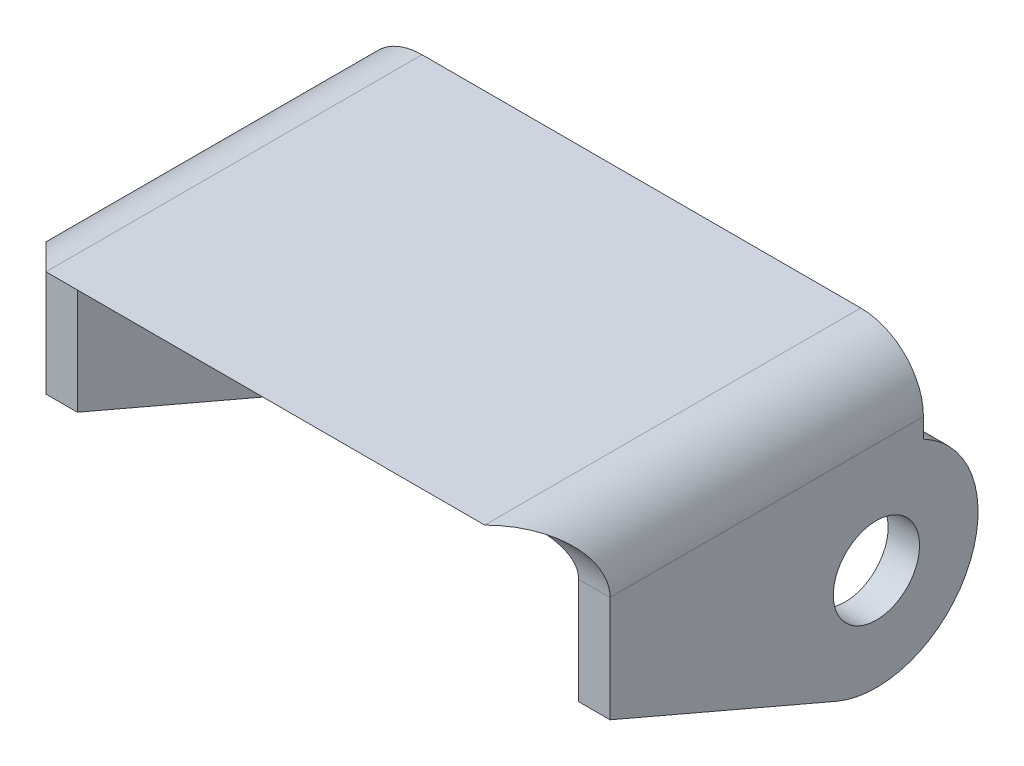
ISO-10303-21;
HEADER;
FILE_DESCRIPTION(('STEP AP214'),'2;1');
FILE_NAME('part.step','',(''),(''),'','','');
FILE_SCHEMA(('AUTOMOTIVE_DESIGN { 1 0 10303 214 1 1 1 1 }'));
ENDSEC;
DATA;
#1=APPLICATION_CONTEXT('core data for automotive mechanical design processes');
#2=APPLICATION_PROTOCOL_DEFINITION('international standard','automotive_design',2000,#1);
#3=PRODUCT_CONTEXT('',#1,'mechanical');
#4=PRODUCT('Part','Part','',(#3));
#5=PRODUCT_RELATED_PRODUCT_CATEGORY('part','',(#4));
#6=PRODUCT_DEFINITION_FORMATION('','',#4);
#7=PRODUCT_DEFINITION_CONTEXT('part definition',#1,'design');
#8=PRODUCT_DEFINITION('design','',#6,#7);
#9=PRODUCT_DEFINITION_SHAPE('','',#8);
#10=(LENGTH_UNIT() NAMED_UNIT(*) SI_UNIT(.MILLI.,.METRE.));
#11=(NAMED_UNIT(*) PLANE_ANGLE_UNIT() SI_UNIT($,.RADIAN.));
#12=(NAMED_UNIT(*) SI_UNIT($,.STERADIAN.) SOLID_ANGLE_UNIT());
#13=UNCERTAINTY_MEASURE_WITH_UNIT(LENGTH_MEASURE(1.E-05),#10,'distance_accuracy_value','');
#14=(GEOMETRIC_REPRESENTATION_CONTEXT(3) GLOBAL_UNCERTAINTY_ASSIGNED_CONTEXT((#13)) GLOBAL_UNIT_ASSIGNED_CONTEXT((#10,
#11,#12)) REPRESENTATION_CONTEXT('',''));
#15=CARTESIAN_POINT('',(0.,0.,0.));
#16=DIRECTION('',(0.,0.,1.));
#17=DIRECTION('',(1.,0.,0.));
#18=AXIS2_PLACEMENT_3D('',#15,#16,#17);
#19=CARTESIAN_POINT('',(153.426643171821,135.018592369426,88.9));
#20=DIRECTION('',(-1.,0.,0.));
#21=DIRECTION('',(0.,-1.,0.));
#22=AXIS2_PLACEMENT_3D('',#19,#20,#21);
#23=PLANE('',#22);
#24=CARTESIAN_POINT('',(153.426643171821,112.793592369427,22.225));
#25=DIRECTION('',(-1.,0.,0.));
#26=DIRECTION('',(0.,-1.,0.));
#27=AXIS2_PLACEMENT_3D('',#24,#25,#26);
#28=CIRCLE('',#27,8.73125000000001);
#29=CARTESIAN_POINT('',(153.426643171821,104.062342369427,22.225));
#30=VERTEX_POINT('',#29);
#31=EDGE_CURVE('E241',#30,#30,#28,.T.);
#32=ORIENTED_EDGE('',*,*,#31,.T.);
#33=EDGE_LOOP('',(#32));
#34=FACE_BOUND('',#33,.T.);
#35=DIRECTION('',(0.,0.,-1.));
#36=VECTOR('',#35,1.);
#37=CARTESIAN_POINT('',(153.426643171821,135.018592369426,88.9));
#38=LINE('',#37,#36);
#39=CARTESIAN_POINT('',(153.426643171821,135.018592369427,76.2));
#40=VERTEX_POINT('',#39);
#41=CARTESIAN_POINT('',(153.426643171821,135.018592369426,12.7));
#42=VERTEX_POINT('',#41);
#43=EDGE_CURVE('E11',#40,#42,#38,.T.);
#44=ORIENTED_EDGE('',*,*,#43,.F.);
#45=DIRECTION('',(0.,-1.,0.));
#46=VECTOR('',#45,1.);
#47=CARTESIAN_POINT('',(153.426643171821,135.018592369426,76.2));
#48=LINE('',#47,#46);
#49=CARTESIAN_POINT('',(153.426643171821,113.547017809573,76.2));
#50=VERTEX_POINT('',#49);
#51=EDGE_CURVE('E245',#40,#50,#48,.T.);
#52=ORIENTED_EDGE('',*,*,#51,.T.);
#53=DIRECTION('',(0.,-0.394402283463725,-0.918937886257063));
#54=VECTOR('',#53,1.);
#55=CARTESIAN_POINT('',(153.426643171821,121.489865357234,94.7064434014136));
#56=LINE('',#55,#54);
#57=CARTESIAN_POINT('',(153.426643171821,93.8675960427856,30.3479169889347));
#58=VERTEX_POINT('',#57);
#59=EDGE_CURVE('E288',#50,#58,#56,.T.);
#60=ORIENTED_EDGE('',*,*,#59,.T.);
#61=CARTESIAN_POINT('',(153.426643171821,112.793592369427,22.225));
#62=DIRECTION('',(-1.,0.,0.));
#63=DIRECTION('',(0.,-1.,0.));
#64=AXIS2_PLACEMENT_3D('',#61,#62,#63);
#65=CIRCLE('',#64,20.5955120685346);
#66=CARTESIAN_POINT('',(153.426643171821,131.05419182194,12.7));
#67=VERTEX_POINT('',#66);
#68=EDGE_CURVE('E293',#58,#67,#65,.F.);
#69=ORIENTED_EDGE('',*,*,#68,.T.);
#70=DIRECTION('',(0.,1.,0.));
#71=VECTOR('',#70,1.);
#72=CARTESIAN_POINT('',(153.426643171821,135.018592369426,12.7));
#73=LINE('',#72,#71);
#74=EDGE_CURVE('E139',#67,#42,#73,.T.);
#75=ORIENTED_EDGE('',*,*,#74,.T.);
#76=EDGE_LOOP('',(#44,#52,#60,#69,#75));
#77=FACE_BOUND('',#76,.T.);
#78=ADVANCED_FACE('F34',(#34,#77),#23,.F.);
#79=CARTESIAN_POINT('',(159.776643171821,135.018592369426,88.9));
#80=DIRECTION('',(0.,0.,-1.));
#81=DIRECTION('',(-1.,0.,0.));
#82=AXIS2_PLACEMENT_3D('',#79,#80,#81);
#83=CYLINDRICAL_SURFACE('',#82,6.34999999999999);
#84=DIRECTION('',(0.,0.,-1.));
#85=VECTOR('',#84,1.);
#86=CARTESIAN_POINT('',(159.776643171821,141.368592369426,88.9));
#87=LINE('',#86,#85);
#88=CARTESIAN_POINT('',(159.776643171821,141.368592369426,77.9014773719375));
#89=VERTEX_POINT('',#88);
#90=CARTESIAN_POINT('',(159.776643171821,141.368592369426,12.7));
#91=VERTEX_POINT('',#90);
#92=EDGE_CURVE('E41',#89,#91,#87,.T.);
#93=ORIENTED_EDGE('',*,*,#92,.F.);
#94=CARTESIAN_POINT('',(159.776643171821,141.368592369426,77.9014773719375));
#95=CARTESIAN_POINT('',(159.610338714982,141.368623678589,77.9015272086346));
#96=CARTESIAN_POINT('',(159.44405766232,141.362060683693,77.8977070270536));
#97=CARTESIAN_POINT('',(159.112947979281,141.335985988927,77.8826977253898));
#98=CARTESIAN_POINT('',(158.948118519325,141.316482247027,77.8715131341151));
#99=CARTESIAN_POINT('',(158.622060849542,141.264915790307,77.8422306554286));
#100=CARTESIAN_POINT('',(158.460817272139,141.232926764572,77.8241733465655));
#101=CARTESIAN_POINT('',(158.142061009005,141.15679181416,77.7817980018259));
#102=CARTESIAN_POINT('',(157.984548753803,141.112644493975,77.7574792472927));
#103=CARTESIAN_POINT('',(157.6746116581,141.012790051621,77.7034469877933));
#104=CARTESIAN_POINT('',(157.52217564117,140.957110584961,77.6737464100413));
#105=CARTESIAN_POINT('',(157.222790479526,140.834650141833,77.6098164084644));
#106=CARTESIAN_POINT('',(157.075843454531,140.767864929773,77.5755852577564));
#107=CARTESIAN_POINT('',(156.643991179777,140.551460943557,77.46744237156));
#108=CARTESIAN_POINT('',(156.368263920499,140.385855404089,77.3881161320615));
#109=CARTESIAN_POINT('',(155.8249323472,140.001198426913,77.2161842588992));
#110=CARTESIAN_POINT('',(155.559834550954,139.778884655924,77.1230231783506));
#111=CARTESIAN_POINT('',(155.068639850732,139.293660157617,76.9383528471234));
#112=CARTESIAN_POINT('',(154.842554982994,139.03073694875,76.8468441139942));
#113=CARTESIAN_POINT('',(154.529931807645,138.600341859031,76.7145252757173));
#114=CARTESIAN_POINT('',(154.427414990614,138.445389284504,76.6699391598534));
#115=CARTESIAN_POINT('',(154.23593149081,138.126258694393,76.5849841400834));
#116=CARTESIAN_POINT('',(154.146958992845,137.962084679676,76.5446134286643));
#117=CARTESIAN_POINT('',(153.983513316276,137.625714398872,76.4692880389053));
#118=CARTESIAN_POINT('',(153.909024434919,137.453527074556,76.4343275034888));
#119=CARTESIAN_POINT('',(153.775281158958,137.102207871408,76.3708189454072));
#120=CARTESIAN_POINT('',(153.716022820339,136.923077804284,76.3422692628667));
#121=CARTESIAN_POINT('',(153.625591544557,136.602235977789,76.2983425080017));
#122=CARTESIAN_POINT('',(153.59109093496,136.461659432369,76.2814467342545));
#123=CARTESIAN_POINT('',(153.531712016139,136.178039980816,76.2522334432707));
#124=CARTESIAN_POINT('',(153.506831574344,136.034997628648,76.2399149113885));
#125=CARTESIAN_POINT('',(153.466863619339,135.746860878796,76.2200749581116));
#126=CARTESIAN_POINT('',(153.451800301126,135.601762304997,76.2125653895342));
#127=CARTESIAN_POINT('',(153.43167985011,135.310643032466,76.2025180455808));
#128=CARTESIAN_POINT('',(153.426626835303,135.164621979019,76.1999823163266));
#129=CARTESIAN_POINT('',(153.426643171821,135.018592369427,76.2));
#130=B_SPLINE_CURVE_WITH_KNOTS('',3,(#94,#95,#96,#97,#98,#99,#100,#101,#102,#103,#104,#105,#106,
#107,#108,#109,#110,#111,#112,#113,#114,#115,#116,#117,#118,#119,#120,#121,#122,#123,#124,#125,
#126,#127,#128,#129),.UNSPECIFIED.,.F.,.F.,(4,2,2,2,2,2,2,2,2,2,2,2,2,2,2,2,2,4),(0.,
0.498703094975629,0.997099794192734,1.49259834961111,1.98815380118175,2.48253433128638,
2.97710384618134,3.96684223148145,5.03748734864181,6.10846219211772,6.68104886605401,
7.25338900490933,7.82510512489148,8.39667304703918,8.83348316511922,9.27019639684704,
9.70798190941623,10.1459474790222),.UNSPECIFIED.);
#131=EDGE_CURVE('E213',#89,#40,#130,.T.);
#132=ORIENTED_EDGE('',*,*,#131,.T.);
#133=ORIENTED_EDGE('',*,*,#43,.T.);
#134=CARTESIAN_POINT('',(159.776643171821,135.018592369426,12.7));
#135=DIRECTION('',(0.,0.,1.));
#136=DIRECTION('',(0.,-1.,0.));
#137=AXIS2_PLACEMENT_3D('',#134,#135,#136);
#138=CIRCLE('',#137,6.34999999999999);
#139=EDGE_CURVE('E248',#42,#91,#138,.F.);
#140=ORIENTED_EDGE('',*,*,#139,.T.);
#141=EDGE_LOOP('',(#93,#132,#133,#140));
#142=FACE_BOUND('',#141,.T.);
#143=ADVANCED_FACE('F221',(#142),#83,.F.);
#144=CARTESIAN_POINT('',(248.676643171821,141.368592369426,88.9));
#145=DIRECTION('',(0.,1.,0.));
#146=DIRECTION('',(-1.,0.,0.));
#147=AXIS2_PLACEMENT_3D('',#144,#145,#146);
#148=PLANE('',#147);
#149=DIRECTION('',(0.,0.,-1.));
#150=VECTOR('',#149,1.);
#151=CARTESIAN_POINT('',(248.676643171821,141.368592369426,88.9));
#152=LINE('',#151,#150);
#153=CARTESIAN_POINT('',(248.676643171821,141.368592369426,77.9014773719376));
#154=VERTEX_POINT('',#153);
#155=CARTESIAN_POINT('',(248.676643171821,141.368592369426,12.7));
#156=VERTEX_POINT('',#155);
#157=EDGE_CURVE('E254',#154,#156,#152,.T.);
#158=ORIENTED_EDGE('',*,*,#157,.F.);
#159=DIRECTION('',(1.,0.,0.));
#160=VECTOR('',#159,1.);
#161=CARTESIAN_POINT('',(147.07664317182,141.368592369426,77.9014773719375));
#162=LINE('',#161,#160);
#163=EDGE_CURVE('E198',#154,#89,#162,.F.);
#164=ORIENTED_EDGE('',*,*,#163,.T.);
#165=ORIENTED_EDGE('',*,*,#92,.T.);
#166=DIRECTION('',(1.,0.,0.));
#167=VECTOR('',#166,1.);
#168=CARTESIAN_POINT('',(248.676643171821,141.368592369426,12.7));
#169=LINE('',#168,#167);
#170=EDGE_CURVE('E255',#91,#156,#169,.T.);
#171=ORIENTED_EDGE('',*,*,#170,.T.);
#172=EDGE_LOOP('',(#158,#164,#165,#171));
#173=FACE_BOUND('',#172,.T.);
#174=ADVANCED_FACE('F224',(#173),#148,.F.);
#175=CARTESIAN_POINT('',(248.676643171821,135.018592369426,88.9));
#176=DIRECTION('',(0.,0.,-1.));
#177=DIRECTION('',(-1.,0.,0.));
#178=AXIS2_PLACEMENT_3D('',#175,#176,#177);
#179=CYLINDRICAL_SURFACE('',#178,6.34999999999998);
#180=DIRECTION('',(0.,0.,-1.));
#181=VECTOR('',#180,1.);
#182=CARTESIAN_POINT('',(255.026643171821,135.018592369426,88.9));
#183=LINE('',#182,#181);
#184=CARTESIAN_POINT('',(255.026643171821,135.018592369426,76.2));
#185=VERTEX_POINT('',#184);
#186=CARTESIAN_POINT('',(255.026643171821,135.018592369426,12.7));
#187=VERTEX_POINT('',#186);
#188=EDGE_CURVE('E257',#185,#187,#183,.T.);
#189=ORIENTED_EDGE('',*,*,#188,.F.);
#190=CARTESIAN_POINT('',(255.026643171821,135.018592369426,76.2));
#191=CARTESIAN_POINT('',(255.026671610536,135.186221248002,76.1999692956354));
#192=CARTESIAN_POINT('',(255.020006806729,135.353835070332,76.2033176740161));
#193=CARTESIAN_POINT('',(254.99350442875,135.687693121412,76.216546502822));
#194=CARTESIAN_POINT('',(254.973672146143,135.853937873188,76.2264243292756));
#195=CARTESIAN_POINT('',(254.92116858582,136.183100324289,76.2524266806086));
#196=CARTESIAN_POINT('',(254.888556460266,136.346029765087,76.2685224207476));
#197=CARTESIAN_POINT('',(254.810872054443,136.668196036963,76.3065449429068));
#198=CARTESIAN_POINT('',(254.765799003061,136.827432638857,76.3284720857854));
#199=CARTESIAN_POINT('',(254.663732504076,137.140948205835,76.3775904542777));
#200=CARTESIAN_POINT('',(254.606756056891,137.29523388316,76.4047741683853));
#201=CARTESIAN_POINT('',(254.481387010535,137.598198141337,76.4637825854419));
#202=CARTESIAN_POINT('',(254.412990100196,137.746874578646,76.4956090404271));
#203=CARTESIAN_POINT('',(254.191420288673,138.183415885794,76.5970362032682));
#204=CARTESIAN_POINT('',(254.021867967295,138.461793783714,76.6725848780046));
#205=CARTESIAN_POINT('',(253.632705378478,139.003303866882,76.8377793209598));
#206=CARTESIAN_POINT('',(253.410705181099,139.264524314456,76.9279984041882));
#207=CARTESIAN_POINT('',(252.927804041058,139.747947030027,77.1105994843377));
#208=CARTESIAN_POINT('',(252.666871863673,139.970117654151,77.2029831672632));
#209=CARTESIAN_POINT('',(252.239358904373,140.278225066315,77.339710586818));
#210=CARTESIAN_POINT('',(252.08462175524,140.379803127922,77.3865961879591));
#211=CARTESIAN_POINT('',(251.766121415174,140.569441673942,77.4768185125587));
#212=CARTESIAN_POINT('',(251.602362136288,140.657507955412,77.5201567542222));
#213=CARTESIAN_POINT('',(251.266966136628,140.819225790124,77.6017322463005));
#214=CARTESIAN_POINT('',(251.095341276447,140.892898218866,77.6399768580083));
#215=CARTESIAN_POINT('',(250.745181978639,141.025141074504,77.7099608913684));
#216=CARTESIAN_POINT('',(250.566652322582,141.083721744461,77.7417047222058));
#217=CARTESIAN_POINT('',(250.247687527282,141.172839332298,77.7906721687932));
#218=CARTESIAN_POINT('',(250.108434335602,141.206732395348,77.8095515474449));
#219=CARTESIAN_POINT('',(249.827410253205,141.265097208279,77.8423197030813));
#220=CARTESIAN_POINT('',(249.685639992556,141.289571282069,77.8562097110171));
#221=CARTESIAN_POINT('',(249.399827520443,141.328930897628,77.8786491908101));
#222=CARTESIAN_POINT('',(249.255778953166,141.343781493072,77.8871791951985));
#223=CARTESIAN_POINT('',(248.966705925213,141.363624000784,77.8986093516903));
#224=CARTESIAN_POINT('',(248.821680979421,141.368610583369,77.9015064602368));
#225=CARTESIAN_POINT('',(248.676643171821,141.368592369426,77.9014773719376));
#226=B_SPLINE_CURVE_WITH_KNOTS('',3,(#190,#191,#192,#193,#194,#195,#196,#197,#198,#199,#200,
#201,#202,#203,#204,#205,#206,#207,#208,#209,#210,#211,#212,#213,#214,#215,#216,#217,#218,#219,
#220,#221,#222,#223,#224,#225),.UNSPECIFIED.,.F.,.F.,(4,2,2,2,2,2,2,2,2,2,2,2,2,2,2,2,2,4),(0.,
0.502697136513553,1.00519237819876,1.50538875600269,2.0056160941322,2.50513383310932,
3.00484056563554,4.00425076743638,5.06351940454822,6.12364249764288,6.69587604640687,
7.26786339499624,7.83901492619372,8.40977777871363,8.84306364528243,9.2762425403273,
9.71098577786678,10.1459638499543),.UNSPECIFIED.);
#227=EDGE_CURVE('E190',#185,#154,#226,.T.);
#228=ORIENTED_EDGE('',*,*,#227,.T.);
#229=ORIENTED_EDGE('',*,*,#157,.T.);
#230=CARTESIAN_POINT('',(248.676643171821,135.018592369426,12.7));
#231=DIRECTION('',(0.,0.,1.));
#232=DIRECTION('',(0.,-1.,0.));
#233=AXIS2_PLACEMENT_3D('',#230,#231,#232);
#234=CIRCLE('',#233,6.34999999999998);
#235=EDGE_CURVE('E301',#156,#187,#234,.F.);
#236=ORIENTED_EDGE('',*,*,#235,.T.);
#237=EDGE_LOOP('',(#189,#228,#229,#236));
#238=FACE_BOUND('',#237,.T.);
#239=ADVANCED_FACE('F200',(#238),#179,.F.);
#240=CARTESIAN_POINT('',(255.026643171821,90.5685923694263,88.9));
#241=DIRECTION('',(1.,0.,0.));
#242=DIRECTION('',(0.,1.,0.));
#243=AXIS2_PLACEMENT_3D('',#240,#241,#242);
#244=PLANE('',#243);
#245=CARTESIAN_POINT('',(255.026643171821,112.793592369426,22.225));
#246=DIRECTION('',(1.,0.,0.));
#247=DIRECTION('',(0.,1.,0.));
#248=AXIS2_PLACEMENT_3D('',#245,#246,#247);
#249=CIRCLE('',#248,8.73125000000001);
#250=CARTESIAN_POINT('',(255.026643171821,121.524842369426,22.225));
#251=VERTEX_POINT('',#250);
#252=EDGE_CURVE('E275',#251,#251,#249,.T.);
#253=ORIENTED_EDGE('',*,*,#252,.T.);
#254=EDGE_LOOP('',(#253));
#255=FACE_BOUND('',#254,.T.);
#256=DIRECTION('',(0.,0.394402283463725,0.918937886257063));
#257=VECTOR('',#256,1.);
#258=CARTESIAN_POINT('',(255.026643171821,114.575527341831,78.5963765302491));
#259=LINE('',#258,#257);
#260=CARTESIAN_POINT('',(255.026643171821,93.8675960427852,30.3479169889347));
#261=VERTEX_POINT('',#260);
#262=CARTESIAN_POINT('',(255.026643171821,113.547017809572,76.2));
#263=VERTEX_POINT('',#262);
#264=EDGE_CURVE('E290',#261,#263,#259,.T.);
#265=ORIENTED_EDGE('',*,*,#264,.T.);
#266=DIRECTION('',(0.,1.,0.));
#267=VECTOR('',#266,1.);
#268=CARTESIAN_POINT('',(255.026643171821,90.5685923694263,76.2));
#269=LINE('',#268,#267);
#270=EDGE_CURVE('E285',#263,#185,#269,.T.);
#271=ORIENTED_EDGE('',*,*,#270,.T.);
#272=ORIENTED_EDGE('',*,*,#188,.T.);
#273=DIRECTION('',(0.,-1.,0.));
#274=VECTOR('',#273,1.);
#275=CARTESIAN_POINT('',(255.026643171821,90.5685923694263,12.7));
#276=LINE('',#275,#274);
#277=CARTESIAN_POINT('',(255.026643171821,131.05419182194,12.7));
#278=VERTEX_POINT('',#277);
#279=EDGE_CURVE('E303',#187,#278,#276,.T.);
#280=ORIENTED_EDGE('',*,*,#279,.T.);
#281=CARTESIAN_POINT('',(255.026643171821,112.793592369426,22.225));
#282=DIRECTION('',(1.,0.,0.));
#283=DIRECTION('',(0.,1.,0.));
#284=AXIS2_PLACEMENT_3D('',#281,#282,#283);
#285=CIRCLE('',#284,20.5955120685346);
#286=EDGE_CURVE('E295',#278,#261,#285,.F.);
#287=ORIENTED_EDGE('',*,*,#286,.T.);
#288=EDGE_LOOP('',(#265,#271,#272,#280,#287));
#289=FACE_BOUND('',#288,.T.);
#290=ADVANCED_FACE('F231',(#255,#289),#244,.F.);
#291=CARTESIAN_POINT('',(261.376643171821,135.018592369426,88.9));
#292=DIRECTION('',(-1.,0.,0.));
#293=DIRECTION('',(0.,-1.,0.));
#294=AXIS2_PLACEMENT_3D('',#291,#292,#293);
#295=PLANE('',#294);
#296=CARTESIAN_POINT('',(261.376643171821,112.793592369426,22.225));
#297=DIRECTION('',(1.,0.,0.));
#298=DIRECTION('',(0.,1.,0.));
#299=AXIS2_PLACEMENT_3D('',#296,#297,#298);
#300=CIRCLE('',#299,8.73125000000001);
#301=CARTESIAN_POINT('',(261.376643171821,121.524842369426,22.225));
#302=VERTEX_POINT('',#301);
#303=EDGE_CURVE('E279',#302,#302,#300,.T.);
#304=ORIENTED_EDGE('',*,*,#303,.F.);
#305=EDGE_LOOP('',(#304));
#306=FACE_BOUND('',#305,.T.);
#307=DIRECTION('',(0.,0.,-1.));
#308=VECTOR('',#307,1.);
#309=CARTESIAN_POINT('',(261.376643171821,135.018592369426,88.9));
#310=LINE('',#309,#308);
#311=CARTESIAN_POINT('',(261.376643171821,135.018592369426,76.2));
#312=VERTEX_POINT('',#311);
#313=CARTESIAN_POINT('',(261.376643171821,135.018592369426,12.7));
#314=VERTEX_POINT('',#313);
#315=EDGE_CURVE('E260',#312,#314,#310,.T.);
#316=ORIENTED_EDGE('',*,*,#315,.F.);
#317=DIRECTION('',(0.,1.,0.));
#318=VECTOR('',#317,1.);
#319=CARTESIAN_POINT('',(261.376643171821,113.547017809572,76.2));
#320=LINE('',#319,#318);
#321=CARTESIAN_POINT('',(261.376643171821,113.547017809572,76.2));
#322=VERTEX_POINT('',#321);
#323=EDGE_CURVE('E159',#322,#312,#320,.T.);
#324=ORIENTED_EDGE('',*,*,#323,.F.);
#325=DIRECTION('',(0.,0.394402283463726,0.918937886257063));
#326=VECTOR('',#325,1.);
#327=CARTESIAN_POINT('',(261.376643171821,93.8675960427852,30.3479169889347));
#328=LINE('',#327,#326);
#329=CARTESIAN_POINT('',(261.376643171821,93.8675960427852,30.3479169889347));
#330=VERTEX_POINT('',#329);
#331=EDGE_CURVE('E162',#330,#322,#328,.T.);
#332=ORIENTED_EDGE('',*,*,#331,.F.);
#333=CARTESIAN_POINT('',(261.376643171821,112.793592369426,22.225));
#334=DIRECTION('',(-1.,0.,0.));
#335=DIRECTION('',(0.,1.,0.));
#336=AXIS2_PLACEMENT_3D('',#333,#334,#335);
#337=CIRCLE('',#336,20.5955120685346);
#338=CARTESIAN_POINT('',(261.376643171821,131.05419182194,12.7));
#339=VERTEX_POINT('',#338);
#340=EDGE_CURVE('E171',#339,#330,#337,.T.);
#341=ORIENTED_EDGE('',*,*,#340,.F.);
#342=DIRECTION('',(0.,-1.,0.));
#343=VECTOR('',#342,1.);
#344=CARTESIAN_POINT('',(261.376643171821,147.718592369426,12.7));
#345=LINE('',#344,#343);
#346=EDGE_CURVE('E169',#314,#339,#345,.T.);
#347=ORIENTED_EDGE('',*,*,#346,.F.);
#348=EDGE_LOOP('',(#316,#324,#332,#341,#347));
#349=FACE_BOUND('',#348,.T.);
#350=ADVANCED_FACE('F320',(#306,#349),#295,.F.);
#351=CARTESIAN_POINT('',(248.676643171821,135.018592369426,88.9));
#352=DIRECTION('',(0.,0.,-1.));
#353=DIRECTION('',(-1.,0.,0.));
#354=AXIS2_PLACEMENT_3D('',#351,#352,#353);
#355=CYLINDRICAL_SURFACE('',#354,12.7);
#356=DIRECTION('',(0.,0.,-1.));
#357=VECTOR('',#356,1.);
#358=CARTESIAN_POINT('',(248.676643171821,147.718592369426,88.9));
#359=LINE('',#358,#357);
#360=CARTESIAN_POINT('',(248.676643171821,147.718592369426,88.9));
#361=VERTEX_POINT('',#360);
#362=CARTESIAN_POINT('',(248.676643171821,147.718592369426,12.7));
#363=VERTEX_POINT('',#362);
#364=EDGE_CURVE('E265',#361,#363,#359,.T.);
#365=ORIENTED_EDGE('',*,*,#364,.F.);
#366=CARTESIAN_POINT('',(248.676643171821,135.018592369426,88.9));
#367=DIRECTION('',(-0.707106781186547,0.,-0.707106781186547));
#368=DIRECTION('',(0.707106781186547,0.,-0.707106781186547));
#369=AXIS2_PLACEMENT_3D('',#366,#367,#368);
#370=ELLIPSE('',#369,17.9605122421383,12.7);
#371=EDGE_CURVE('E56',#361,#312,#370,.T.);
#372=ORIENTED_EDGE('',*,*,#371,.T.);
#373=ORIENTED_EDGE('',*,*,#315,.T.);
#374=CARTESIAN_POINT('',(248.676643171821,135.018592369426,12.7));
#375=DIRECTION('',(0.,0.,1.));
#376=DIRECTION('',(0.,-1.,0.));
#377=AXIS2_PLACEMENT_3D('',#374,#375,#376);
#378=CIRCLE('',#377,12.7);
#379=EDGE_CURVE('E305',#314,#363,#378,.T.);
#380=ORIENTED_EDGE('',*,*,#379,.T.);
#381=EDGE_LOOP('',(#365,#372,#373,#380));
#382=FACE_BOUND('',#381,.T.);
#383=ADVANCED_FACE('F315',(#382),#355,.T.);
#384=CARTESIAN_POINT('',(159.776643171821,147.718592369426,88.9));
#385=DIRECTION('',(0.,-1.,0.));
#386=DIRECTION('',(1.,0.,0.));
#387=AXIS2_PLACEMENT_3D('',#384,#385,#386);
#388=PLANE('',#387);
#389=ORIENTED_EDGE('',*,*,#364,.T.);
#390=DIRECTION('',(1.,0.,0.));
#391=VECTOR('',#390,1.);
#392=CARTESIAN_POINT('',(147.076643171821,147.718592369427,12.7));
#393=LINE('',#392,#391);
#394=CARTESIAN_POINT('',(159.776643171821,147.718592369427,12.7));
#395=VERTEX_POINT('',#394);
#396=EDGE_CURVE('E168',#395,#363,#393,.T.);
#397=ORIENTED_EDGE('',*,*,#396,.F.);
#398=DIRECTION('',(0.,0.,-1.));
#399=VECTOR('',#398,1.);
#400=CARTESIAN_POINT('',(159.776643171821,147.718592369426,88.9));
#401=LINE('',#400,#399);
#402=CARTESIAN_POINT('',(159.776643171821,147.718592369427,88.9));
#403=VERTEX_POINT('',#402);
#404=EDGE_CURVE('E268',#403,#395,#401,.T.);
#405=ORIENTED_EDGE('',*,*,#404,.F.);
#406=DIRECTION('',(-1.,0.,0.));
#407=VECTOR('',#406,1.);
#408=CARTESIAN_POINT('',(159.776643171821,147.718592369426,88.9));
#409=LINE('',#408,#407);
#410=EDGE_CURVE('E272',#361,#403,#409,.T.);
#411=ORIENTED_EDGE('',*,*,#410,.F.);
#412=EDGE_LOOP('',(#389,#397,#405,#411));
#413=FACE_BOUND('',#412,.T.);
#414=ADVANCED_FACE('F313',(#413),#388,.F.);
#415=CARTESIAN_POINT('',(159.776643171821,135.018592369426,88.9));
#416=DIRECTION('',(0.,0.,-1.));
#417=DIRECTION('',(-1.,0.,0.));
#418=AXIS2_PLACEMENT_3D('',#415,#416,#417);
#419=CYLINDRICAL_SURFACE('',#418,12.7);
#420=DIRECTION('',(0.,0.,-1.));
#421=VECTOR('',#420,1.);
#422=CARTESIAN_POINT('',(147.076643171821,135.018592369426,88.9));
#423=LINE('',#422,#421);
#424=CARTESIAN_POINT('',(147.07664317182,135.018592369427,76.2));
#425=VERTEX_POINT('',#424);
#426=CARTESIAN_POINT('',(147.07664317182,135.018592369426,12.7));
#427=VERTEX_POINT('',#426);
#428=EDGE_CURVE('E158',#425,#427,#423,.T.);
#429=ORIENTED_EDGE('',*,*,#428,.F.);
#430=CARTESIAN_POINT('',(159.776643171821,135.018592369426,88.9));
#431=DIRECTION('',(0.707106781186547,0.,-0.707106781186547));
#432=DIRECTION('',(-0.707106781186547,0.,-0.707106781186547));
#433=AXIS2_PLACEMENT_3D('',#430,#431,#432);
#434=ELLIPSE('',#433,17.9605122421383,12.7);
#435=EDGE_CURVE('E179',#425,#403,#434,.T.);
#436=ORIENTED_EDGE('',*,*,#435,.T.);
#437=ORIENTED_EDGE('',*,*,#404,.T.);
#438=CARTESIAN_POINT('',(159.776643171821,135.018592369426,12.7));
#439=DIRECTION('',(0.,0.,1.));
#440=DIRECTION('',(0.,-1.,0.));
#441=AXIS2_PLACEMENT_3D('',#438,#439,#440);
#442=CIRCLE('',#441,12.7);
#443=EDGE_CURVE('E219',#395,#427,#442,.T.);
#444=ORIENTED_EDGE('',*,*,#443,.T.);
#445=EDGE_LOOP('',(#429,#436,#437,#444));
#446=FACE_BOUND('',#445,.T.);
#447=ADVANCED_FACE('F309',(#446),#419,.T.);
#448=CARTESIAN_POINT('',(147.076643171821,90.5685923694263,88.9));
#449=DIRECTION('',(1.,0.,0.));
#450=DIRECTION('',(0.,1.,0.));
#451=AXIS2_PLACEMENT_3D('',#448,#449,#450);
#452=PLANE('',#451);
#453=CARTESIAN_POINT('',(147.07664317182,112.793592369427,22.225));
#454=DIRECTION('',(1.,0.,0.));
#455=DIRECTION('',(0.,1.,0.));
#456=AXIS2_PLACEMENT_3D('',#453,#454,#455);
#457=CIRCLE('',#456,8.73125000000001);
#458=CARTESIAN_POINT('',(147.07664317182,121.524842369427,22.225));
#459=VERTEX_POINT('',#458);
#460=EDGE_CURVE('E278',#459,#459,#457,.T.);
#461=ORIENTED_EDGE('',*,*,#460,.T.);
#462=EDGE_LOOP('',(#461));
#463=FACE_BOUND('',#462,.T.);
#464=DIRECTION('',(0.,0.394402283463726,0.918937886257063));
#465=VECTOR('',#464,1.);
#466=CARTESIAN_POINT('',(147.07664317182,93.8675960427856,30.3479169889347));
#467=LINE('',#466,#465);
#468=CARTESIAN_POINT('',(147.07664317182,93.8675960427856,30.3479169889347));
#469=VERTEX_POINT('',#468);
#470=CARTESIAN_POINT('',(147.07664317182,113.547017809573,76.2));
#471=VERTEX_POINT('',#470);
#472=EDGE_CURVE('E152',#469,#471,#467,.T.);
#473=ORIENTED_EDGE('',*,*,#472,.T.);
#474=DIRECTION('',(0.,1.,0.));
#475=VECTOR('',#474,1.);
#476=CARTESIAN_POINT('',(147.07664317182,113.547017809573,76.2));
#477=LINE('',#476,#475);
#478=EDGE_CURVE('E166',#471,#425,#477,.T.);
#479=ORIENTED_EDGE('',*,*,#478,.T.);
#480=ORIENTED_EDGE('',*,*,#428,.T.);
#481=DIRECTION('',(0.,-1.,0.));
#482=VECTOR('',#481,1.);
#483=CARTESIAN_POINT('',(147.076643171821,147.718592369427,12.7));
#484=LINE('',#483,#482);
#485=CARTESIAN_POINT('',(147.07664317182,131.054191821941,12.7));
#486=VERTEX_POINT('',#485);
#487=EDGE_CURVE('E136',#427,#486,#484,.T.);
#488=ORIENTED_EDGE('',*,*,#487,.T.);
#489=CARTESIAN_POINT('',(147.07664317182,112.793592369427,22.225));
#490=DIRECTION('',(-1.,0.,0.));
#491=DIRECTION('',(0.,1.,0.));
#492=AXIS2_PLACEMENT_3D('',#489,#490,#491);
#493=CIRCLE('',#492,20.5955120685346);
#494=EDGE_CURVE('E145',#486,#469,#493,.T.);
#495=ORIENTED_EDGE('',*,*,#494,.T.);
#496=EDGE_LOOP('',(#473,#479,#480,#488,#495));
#497=FACE_BOUND('',#496,.T.);
#498=ADVANCED_FACE('F155',(#463,#497),#452,.F.);
#499=CARTESIAN_POINT('',(147.07664317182,112.793592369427,22.225));
#500=DIRECTION('',(1.,0.,0.));
#501=DIRECTION('',(0.,1.,0.));
#502=AXIS2_PLACEMENT_3D('',#499,#500,#501);
#503=CYLINDRICAL_SURFACE('',#502,8.73125000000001);
#504=ORIENTED_EDGE('',*,*,#460,.F.);
#505=EDGE_LOOP('',(#504));
#506=FACE_BOUND('',#505,.T.);
#507=ORIENTED_EDGE('',*,*,#31,.F.);
#508=EDGE_LOOP('',(#507));
#509=FACE_BOUND('',#508,.T.);
#510=ADVANCED_FACE('F210',(#506,#509),#503,.F.);
#511=ORIENTED_EDGE('',*,*,#303,.T.);
#512=EDGE_LOOP('',(#511));
#513=FACE_BOUND('',#512,.T.);
#514=ORIENTED_EDGE('',*,*,#252,.F.);
#515=EDGE_LOOP('',(#514));
#516=FACE_BOUND('',#515,.T.);
#517=ADVANCED_FACE('F345',(#513,#516),#503,.F.);
#518=CARTESIAN_POINT('',(147.07664317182,113.547017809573,76.2));
#519=DIRECTION('',(0.,0.,-1.));
#520=DIRECTION('',(-1.,0.,0.));
#521=AXIS2_PLACEMENT_3D('',#518,#519,#520);
#522=PLANE('',#521);
#523=DIRECTION('',(1.,0.,0.));
#524=VECTOR('',#523,1.);
#525=CARTESIAN_POINT('',(147.07664317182,135.018592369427,76.2));
#526=LINE('',#525,#524);
#527=EDGE_CURVE('E176',#425,#40,#526,.T.);
#528=ORIENTED_EDGE('',*,*,#527,.F.);
#529=ORIENTED_EDGE('',*,*,#478,.F.);
#530=DIRECTION('',(1.,0.,0.));
#531=VECTOR('',#530,1.);
#532=CARTESIAN_POINT('',(147.07664317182,113.547017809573,76.2));
#533=LINE('',#532,#531);
#534=EDGE_CURVE('E181',#471,#50,#533,.T.);
#535=ORIENTED_EDGE('',*,*,#534,.T.);
#536=ORIENTED_EDGE('',*,*,#51,.F.);
#537=EDGE_LOOP('',(#528,#529,#535,#536));
#538=FACE_BOUND('',#537,.T.);
#539=ADVANCED_FACE('F343',(#538),#522,.F.);
#540=EDGE_CURVE('E184',#263,#322,#533,.T.);
#541=ORIENTED_EDGE('',*,*,#540,.T.);
#542=ORIENTED_EDGE('',*,*,#323,.T.);
#543=EDGE_CURVE('E180',#185,#312,#526,.T.);
#544=ORIENTED_EDGE('',*,*,#543,.F.);
#545=ORIENTED_EDGE('',*,*,#270,.F.);
#546=EDGE_LOOP('',(#541,#542,#544,#545));
#547=FACE_BOUND('',#546,.T.);
#548=ADVANCED_FACE('F330',(#547),#522,.F.);
#549=CARTESIAN_POINT('',(147.07664317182,93.8675960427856,30.3479169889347));
#550=DIRECTION('',(0.,0.918937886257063,-0.394402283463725));
#551=DIRECTION('',(0.,0.394402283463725,0.918937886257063));
#552=AXIS2_PLACEMENT_3D('',#549,#550,#551);
#553=PLANE('',#552);
#554=ORIENTED_EDGE('',*,*,#534,.F.);
#555=ORIENTED_EDGE('',*,*,#472,.F.);
#556=DIRECTION('',(1.,0.,0.));
#557=VECTOR('',#556,1.);
#558=CARTESIAN_POINT('',(147.07664317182,93.8675960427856,30.3479169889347));
#559=LINE('',#558,#557);
#560=EDGE_CURVE('E148',#469,#58,#559,.T.);
#561=ORIENTED_EDGE('',*,*,#560,.T.);
#562=ORIENTED_EDGE('',*,*,#59,.F.);
#563=EDGE_LOOP('',(#554,#555,#561,#562));
#564=FACE_BOUND('',#563,.T.);
#565=ADVANCED_FACE('F335',(#564),#553,.F.);
#566=EDGE_CURVE('E142',#261,#330,#559,.T.);
#567=ORIENTED_EDGE('',*,*,#566,.T.);
#568=ORIENTED_EDGE('',*,*,#331,.T.);
#569=ORIENTED_EDGE('',*,*,#540,.F.);
#570=ORIENTED_EDGE('',*,*,#264,.F.);
#571=EDGE_LOOP('',(#567,#568,#569,#570));
#572=FACE_BOUND('',#571,.T.);
#573=ADVANCED_FACE('F333',(#572),#553,.F.);
#574=CARTESIAN_POINT('',(147.07664317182,112.793592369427,22.225));
#575=DIRECTION('',(1.,0.,0.));
#576=DIRECTION('',(0.,1.,0.));
#577=AXIS2_PLACEMENT_3D('',#574,#575,#576);
#578=CYLINDRICAL_SURFACE('',#577,20.5955120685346);
#579=ORIENTED_EDGE('',*,*,#560,.F.);
#580=ORIENTED_EDGE('',*,*,#494,.F.);
#581=DIRECTION('',(1.,0.,0.));
#582=VECTOR('',#581,1.);
#583=CARTESIAN_POINT('',(147.07664317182,131.054191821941,12.7));
#584=LINE('',#583,#582);
#585=EDGE_CURVE('E132',#486,#67,#584,.T.);
#586=ORIENTED_EDGE('',*,*,#585,.T.);
#587=ORIENTED_EDGE('',*,*,#68,.F.);
#588=EDGE_LOOP('',(#579,#580,#586,#587));
#589=FACE_BOUND('',#588,.T.);
#590=ADVANCED_FACE('F146',(#589),#578,.T.);
#591=EDGE_CURVE('E48',#278,#339,#584,.T.);
#592=ORIENTED_EDGE('',*,*,#591,.T.);
#593=ORIENTED_EDGE('',*,*,#340,.T.);
#594=ORIENTED_EDGE('',*,*,#566,.F.);
#595=ORIENTED_EDGE('',*,*,#286,.F.);
#596=EDGE_LOOP('',(#592,#593,#594,#595));
#597=FACE_BOUND('',#596,.T.);
#598=ADVANCED_FACE('F325',(#597),#578,.T.);
#599=CARTESIAN_POINT('',(147.076643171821,147.718592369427,12.7));
#600=DIRECTION('',(0.,0.,1.));
#601=DIRECTION('',(0.,-1.,0.));
#602=AXIS2_PLACEMENT_3D('',#599,#600,#601);
#603=PLANE('',#602);
#604=ORIENTED_EDGE('',*,*,#585,.F.);
#605=ORIENTED_EDGE('',*,*,#487,.F.);
#606=ORIENTED_EDGE('',*,*,#443,.F.);
#607=ORIENTED_EDGE('',*,*,#396,.T.);
#608=ORIENTED_EDGE('',*,*,#379,.F.);
#609=ORIENTED_EDGE('',*,*,#346,.T.);
#610=ORIENTED_EDGE('',*,*,#591,.F.);
#611=ORIENTED_EDGE('',*,*,#279,.F.);
#612=ORIENTED_EDGE('',*,*,#235,.F.);
#613=ORIENTED_EDGE('',*,*,#170,.F.);
#614=ORIENTED_EDGE('',*,*,#139,.F.);
#615=ORIENTED_EDGE('',*,*,#74,.F.);
#616=EDGE_LOOP('',(#604,#605,#606,#607,#608,#609,#610,#611,#612,#613,#614,#615));
#617=FACE_BOUND('',#616,.T.);
#618=ADVANCED_FACE('F134',(#617),#603,.F.);
#619=CARTESIAN_POINT('',(147.07664317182,135.018592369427,88.9));
#620=DIRECTION('',(1.,0.,0.));
#621=DIRECTION('',(0.,1.,0.));
#622=AXIS2_PLACEMENT_3D('',#619,#620,#621);
#623=CYLINDRICAL_SURFACE('',#622,12.7);
#624=ORIENTED_EDGE('',*,*,#163,.F.);
#625=ORIENTED_EDGE('',*,*,#227,.F.);
#626=ORIENTED_EDGE('',*,*,#543,.T.);
#627=ORIENTED_EDGE('',*,*,#371,.F.);
#628=ORIENTED_EDGE('',*,*,#410,.T.);
#629=ORIENTED_EDGE('',*,*,#435,.F.);
#630=ORIENTED_EDGE('',*,*,#527,.T.);
#631=ORIENTED_EDGE('',*,*,#131,.F.);
#632=EDGE_LOOP('',(#624,#625,#626,#627,#628,#629,#630,#631));
#633=FACE_BOUND('',#632,.T.);
#634=ADVANCED_FACE('F204',(#633),#623,.F.);
#635=CLOSED_SHELL('',(#78,#143,#174,#239,#290,#350,#383,#414,#447,#498,#510,#517,#539,#548,#565,
#573,#590,#598,#618,#634));
#636=MANIFOLD_SOLID_BREP('B2',#635);
#637=ADVANCED_BREP_SHAPE_REPRESENTATION('',(#18,#636),#14);
#638=SHAPE_DEFINITION_REPRESENTATION(#9,#637);
ENDSEC;
END-ISO-10303-21;
